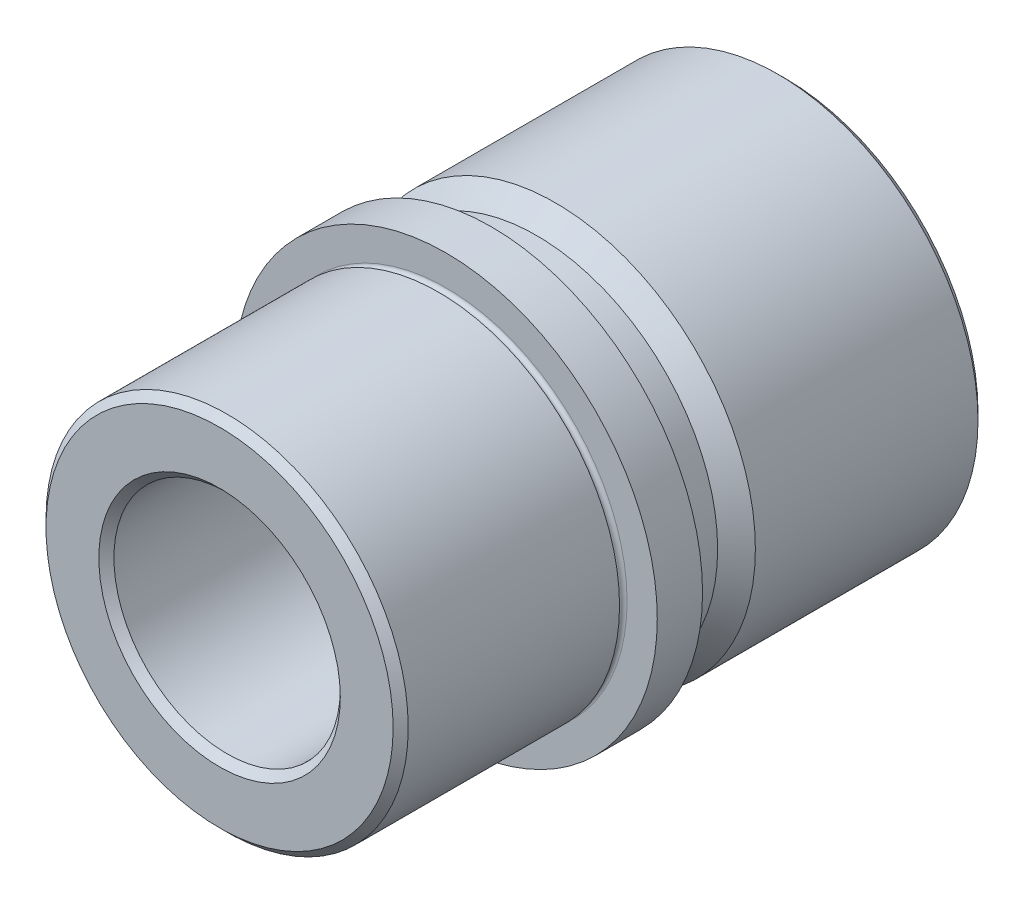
ISO-10303-21;
HEADER;
FILE_DESCRIPTION(('STEP AP214'),'2;1');
FILE_NAME('part.step','',(''),(''),'','','');
FILE_SCHEMA(('AUTOMOTIVE_DESIGN { 1 0 10303 214 1 1 1 1 }'));
ENDSEC;
DATA;
#1=APPLICATION_CONTEXT('core data for automotive mechanical design processes');
#2=APPLICATION_PROTOCOL_DEFINITION('international standard','automotive_design',2000,#1);
#3=PRODUCT_CONTEXT('',#1,'mechanical');
#4=PRODUCT('Part','Part','',(#3));
#5=PRODUCT_RELATED_PRODUCT_CATEGORY('part','',(#4));
#6=PRODUCT_DEFINITION_FORMATION('','',#4);
#7=PRODUCT_DEFINITION_CONTEXT('part definition',#1,'design');
#8=PRODUCT_DEFINITION('design','',#6,#7);
#9=PRODUCT_DEFINITION_SHAPE('','',#8);
#10=(LENGTH_UNIT() NAMED_UNIT(*) SI_UNIT(.MILLI.,.METRE.));
#11=(NAMED_UNIT(*) PLANE_ANGLE_UNIT() SI_UNIT($,.RADIAN.));
#12=(NAMED_UNIT(*) SI_UNIT($,.STERADIAN.) SOLID_ANGLE_UNIT());
#13=UNCERTAINTY_MEASURE_WITH_UNIT(LENGTH_MEASURE(1.E-05),#10,'distance_accuracy_value','');
#14=(GEOMETRIC_REPRESENTATION_CONTEXT(3) GLOBAL_UNCERTAINTY_ASSIGNED_CONTEXT((#13)) GLOBAL_UNIT_ASSIGNED_CONTEXT((#10,
#11,#12)) REPRESENTATION_CONTEXT('',''));
#15=CARTESIAN_POINT('',(0.,0.,0.));
#16=DIRECTION('',(0.,0.,1.));
#17=DIRECTION('',(1.,0.,0.));
#18=AXIS2_PLACEMENT_3D('',#15,#16,#17);
#19=CARTESIAN_POINT('',(0.,0.,-47.5));
#20=DIRECTION('',(0.,0.,1.));
#21=DIRECTION('',(1.,0.,0.));
#22=AXIS2_PLACEMENT_3D('',#19,#20,#21);
#23=TOROIDAL_SURFACE('',#22,15.5,0.5);
#24=CARTESIAN_POINT('',(0.,0.,-47.5));
#25=DIRECTION('',(0.,0.,1.));
#26=DIRECTION('',(1.,0.,0.));
#27=AXIS2_PLACEMENT_3D('',#24,#25,#26);
#28=CIRCLE('',#27,15.);
#29=CARTESIAN_POINT('',(15.,0.,-47.5));
#30=VERTEX_POINT('',#29);
#31=EDGE_CURVE('E81',#30,#30,#28,.T.);
#32=ORIENTED_EDGE('',*,*,#31,.T.);
#33=EDGE_LOOP('',(#32));
#34=FACE_BOUND('',#33,.T.);
#35=CARTESIAN_POINT('',(0.,0.,-48.));
#36=DIRECTION('',(0.,0.,1.));
#37=DIRECTION('',(1.,0.,0.));
#38=AXIS2_PLACEMENT_3D('',#35,#36,#37);
#39=CIRCLE('',#38,15.5);
#40=CARTESIAN_POINT('',(15.5,0.,-48.));
#41=VERTEX_POINT('',#40);
#42=EDGE_CURVE('E45',#41,#41,#39,.T.);
#43=ORIENTED_EDGE('',*,*,#42,.F.);
#44=EDGE_LOOP('',(#43));
#45=FACE_BOUND('',#44,.T.);
#46=ADVANCED_FACE('F13',(#34,#45),#23,.T.);
#47=CARTESIAN_POINT('',(0.,0.,-48.5));
#48=DIRECTION('',(0.,0.,1.));
#49=DIRECTION('',(1.,0.,0.));
#50=AXIS2_PLACEMENT_3D('',#47,#48,#49);
#51=TOROIDAL_SURFACE('',#50,15.5,0.5);
#52=CARTESIAN_POINT('',(0.,0.,-48.5));
#53=DIRECTION('',(0.,0.,1.));
#54=DIRECTION('',(1.,0.,0.));
#55=AXIS2_PLACEMENT_3D('',#52,#53,#54);
#56=CIRCLE('',#55,15.);
#57=CARTESIAN_POINT('',(15.,0.,-48.5));
#58=VERTEX_POINT('',#57);
#59=EDGE_CURVE('E48',#58,#58,#56,.T.);
#60=ORIENTED_EDGE('',*,*,#59,.F.);
#61=EDGE_LOOP('',(#60));
#62=FACE_BOUND('',#61,.T.);
#63=ORIENTED_EDGE('',*,*,#42,.T.);
#64=EDGE_LOOP('',(#63));
#65=FACE_BOUND('',#64,.T.);
#66=ADVANCED_FACE('F114',(#62,#65),#51,.T.);
#67=CARTESIAN_POINT('',(0.,0.,0.));
#68=DIRECTION('',(0.,0.,1.));
#69=DIRECTION('',(1.,0.,0.));
#70=AXIS2_PLACEMENT_3D('',#67,#68,#69);
#71=CYLINDRICAL_SURFACE('',#70,15.);
#72=CARTESIAN_POINT('',(0.,0.,-74.));
#73=DIRECTION('',(0.,0.,1.));
#74=DIRECTION('',(1.,0.,0.));
#75=AXIS2_PLACEMENT_3D('',#72,#73,#74);
#76=CIRCLE('',#75,15.);
#77=CARTESIAN_POINT('',(15.,0.,-74.));
#78=VERTEX_POINT('',#77);
#79=EDGE_CURVE('E36',#78,#78,#76,.F.);
#80=ORIENTED_EDGE('',*,*,#79,.T.);
#81=EDGE_LOOP('',(#80));
#82=FACE_BOUND('',#81,.T.);
#83=ORIENTED_EDGE('',*,*,#59,.T.);
#84=EDGE_LOOP('',(#83));
#85=FACE_BOUND('',#84,.T.);
#86=ADVANCED_FACE('F120',(#82,#85),#71,.F.);
#87=CARTESIAN_POINT('',(0.,0.,-75.));
#88=DIRECTION('',(0.,0.,1.));
#89=DIRECTION('',(1.,0.,0.));
#90=AXIS2_PLACEMENT_3D('',#87,#88,#89);
#91=PLANE('',#90);
#92=CARTESIAN_POINT('',(0.,0.,-75.));
#93=DIRECTION('',(0.,0.,1.));
#94=DIRECTION('',(1.,0.,0.));
#95=AXIS2_PLACEMENT_3D('',#92,#93,#94);
#96=CIRCLE('',#95,16.);
#97=CARTESIAN_POINT('',(16.,0.,-75.));
#98=VERTEX_POINT('',#97);
#99=EDGE_CURVE('E39',#98,#98,#96,.T.);
#100=ORIENTED_EDGE('',*,*,#99,.T.);
#101=EDGE_LOOP('',(#100));
#102=FACE_BOUND('',#101,.T.);
#103=CARTESIAN_POINT('',(0.,0.,-75.));
#104=DIRECTION('',(0.,0.,1.));
#105=DIRECTION('',(1.,0.,0.));
#106=AXIS2_PLACEMENT_3D('',#103,#104,#105);
#107=CIRCLE('',#106,25.5);
#108=CARTESIAN_POINT('',(25.5,0.,-75.));
#109=VERTEX_POINT('',#108);
#110=EDGE_CURVE('E42',#109,#109,#107,.F.);
#111=ORIENTED_EDGE('',*,*,#110,.T.);
#112=EDGE_LOOP('',(#111));
#113=FACE_BOUND('',#112,.T.);
#114=ADVANCED_FACE('F185',(#102,#113),#91,.F.);
#115=CARTESIAN_POINT('',(0.,0.,0.));
#116=DIRECTION('',(0.,0.,1.));
#117=DIRECTION('',(1.,0.,0.));
#118=AXIS2_PLACEMENT_3D('',#115,#116,#117);
#119=CYLINDRICAL_SURFACE('',#118,26.5);
#120=CARTESIAN_POINT('',(0.,0.,-74.));
#121=DIRECTION('',(0.,0.,1.));
#122=DIRECTION('',(1.,0.,0.));
#123=AXIS2_PLACEMENT_3D('',#120,#121,#122);
#124=CIRCLE('',#123,26.5);
#125=CARTESIAN_POINT('',(26.5,0.,-74.));
#126=VERTEX_POINT('',#125);
#127=EDGE_CURVE('E33',#126,#126,#124,.T.);
#128=ORIENTED_EDGE('',*,*,#127,.T.);
#129=EDGE_LOOP('',(#128));
#130=FACE_BOUND('',#129,.T.);
#131=CARTESIAN_POINT('',(0.,0.,-44.5));
#132=DIRECTION('',(0.,0.,1.));
#133=DIRECTION('',(1.,0.,0.));
#134=AXIS2_PLACEMENT_3D('',#131,#132,#133);
#135=CIRCLE('',#134,26.5);
#136=CARTESIAN_POINT('',(26.5,0.,-44.5));
#137=VERTEX_POINT('',#136);
#138=EDGE_CURVE('E51',#137,#137,#135,.T.);
#139=ORIENTED_EDGE('',*,*,#138,.F.);
#140=EDGE_LOOP('',(#139));
#141=FACE_BOUND('',#140,.T.);
#142=ADVANCED_FACE('F181',(#130,#141),#119,.T.);
#143=CARTESIAN_POINT('',(0.,0.,-42.));
#144=DIRECTION('',(0.,0.,-1.));
#145=DIRECTION('',(-1.,0.,0.));
#146=AXIS2_PLACEMENT_3D('',#143,#144,#145);
#147=CONICAL_SURFACE('',#146,24.,0.78539816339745);
#148=ORIENTED_EDGE('',*,*,#138,.T.);
#149=EDGE_LOOP('',(#148));
#150=FACE_BOUND('',#149,.T.);
#151=CARTESIAN_POINT('',(0.,0.,-42.));
#152=DIRECTION('',(0.,0.,1.));
#153=DIRECTION('',(1.,0.,0.));
#154=AXIS2_PLACEMENT_3D('',#151,#152,#153);
#155=CIRCLE('',#154,24.);
#156=CARTESIAN_POINT('',(24.,0.,-42.));
#157=VERTEX_POINT('',#156);
#158=EDGE_CURVE('E54',#157,#157,#155,.T.);
#159=ORIENTED_EDGE('',*,*,#158,.F.);
#160=EDGE_LOOP('',(#159));
#161=FACE_BOUND('',#160,.T.);
#162=ADVANCED_FACE('F177',(#150,#161),#147,.T.);
#163=CARTESIAN_POINT('',(0.,0.,0.));
#164=DIRECTION('',(0.,0.,1.));
#165=DIRECTION('',(1.,0.,0.));
#166=AXIS2_PLACEMENT_3D('',#163,#164,#165);
#167=CYLINDRICAL_SURFACE('',#166,24.);
#168=ORIENTED_EDGE('',*,*,#158,.T.);
#169=EDGE_LOOP('',(#168));
#170=FACE_BOUND('',#169,.T.);
#171=CARTESIAN_POINT('',(0.,0.,-36.));
#172=DIRECTION('',(0.,0.,1.));
#173=DIRECTION('',(1.,0.,0.));
#174=AXIS2_PLACEMENT_3D('',#171,#172,#173);
#175=CIRCLE('',#174,24.);
#176=CARTESIAN_POINT('',(24.,0.,-36.));
#177=VERTEX_POINT('',#176);
#178=EDGE_CURVE('E57',#177,#177,#175,.T.);
#179=ORIENTED_EDGE('',*,*,#178,.F.);
#180=EDGE_LOOP('',(#179));
#181=FACE_BOUND('',#180,.T.);
#182=ADVANCED_FACE('F173',(#170,#181),#167,.T.);
#183=CARTESIAN_POINT('',(0.,0.,-36.));
#184=DIRECTION('',(0.,0.,-1.));
#185=DIRECTION('',(-1.,0.,0.));
#186=AXIS2_PLACEMENT_3D('',#183,#184,#185);
#187=PLANE('',#186);
#188=ORIENTED_EDGE('',*,*,#178,.T.);
#189=EDGE_LOOP('',(#188));
#190=FACE_BOUND('',#189,.T.);
#191=CARTESIAN_POINT('',(0.,0.,-36.));
#192=DIRECTION('',(0.,0.,1.));
#193=DIRECTION('',(1.,0.,0.));
#194=AXIS2_PLACEMENT_3D('',#191,#192,#193);
#195=CIRCLE('',#194,28.);
#196=CARTESIAN_POINT('',(28.,0.,-36.));
#197=VERTEX_POINT('',#196);
#198=EDGE_CURVE('E60',#197,#197,#195,.T.);
#199=ORIENTED_EDGE('',*,*,#198,.F.);
#200=EDGE_LOOP('',(#199));
#201=FACE_BOUND('',#200,.T.);
#202=ADVANCED_FACE('F169',(#190,#201),#187,.T.);
#203=CARTESIAN_POINT('',(0.,0.,0.));
#204=DIRECTION('',(0.,0.,1.));
#205=DIRECTION('',(1.,0.,0.));
#206=AXIS2_PLACEMENT_3D('',#203,#204,#205);
#207=CYLINDRICAL_SURFACE('',#206,28.);
#208=ORIENTED_EDGE('',*,*,#198,.T.);
#209=EDGE_LOOP('',(#208));
#210=FACE_BOUND('',#209,.T.);
#211=CARTESIAN_POINT('',(0.,0.,-30.));
#212=DIRECTION('',(0.,0.,1.));
#213=DIRECTION('',(1.,0.,0.));
#214=AXIS2_PLACEMENT_3D('',#211,#212,#213);
#215=CIRCLE('',#214,28.);
#216=CARTESIAN_POINT('',(28.,0.,-30.));
#217=VERTEX_POINT('',#216);
#218=EDGE_CURVE('E63',#217,#217,#215,.T.);
#219=ORIENTED_EDGE('',*,*,#218,.F.);
#220=EDGE_LOOP('',(#219));
#221=FACE_BOUND('',#220,.T.);
#222=ADVANCED_FACE('F165',(#210,#221),#207,.T.);
#223=CARTESIAN_POINT('',(0.,0.,-30.));
#224=DIRECTION('',(0.,0.,1.));
#225=DIRECTION('',(1.,0.,0.));
#226=AXIS2_PLACEMENT_3D('',#223,#224,#225);
#227=PLANE('',#226);
#228=ORIENTED_EDGE('',*,*,#218,.T.);
#229=EDGE_LOOP('',(#228));
#230=FACE_BOUND('',#229,.T.);
#231=CARTESIAN_POINT('',(0.,0.,-30.));
#232=DIRECTION('',(0.,0.,1.));
#233=DIRECTION('',(1.,0.,0.));
#234=AXIS2_PLACEMENT_3D('',#231,#232,#233);
#235=CIRCLE('',#234,24.);
#236=CARTESIAN_POINT('',(24.,0.,-30.));
#237=VERTEX_POINT('',#236);
#238=EDGE_CURVE('E66',#237,#237,#235,.T.);
#239=ORIENTED_EDGE('',*,*,#238,.F.);
#240=EDGE_LOOP('',(#239));
#241=FACE_BOUND('',#240,.T.);
#242=ADVANCED_FACE('F161',(#230,#241),#227,.T.);
#243=CARTESIAN_POINT('',(0.,0.,-29.5));
#244=DIRECTION('',(0.,0.,1.));
#245=DIRECTION('',(1.,0.,0.));
#246=AXIS2_PLACEMENT_3D('',#243,#244,#245);
#247=TOROIDAL_SURFACE('',#246,24.,0.5);
#248=ORIENTED_EDGE('',*,*,#238,.T.);
#249=EDGE_LOOP('',(#248));
#250=FACE_BOUND('',#249,.T.);
#251=CARTESIAN_POINT('',(0.,0.,-29.));
#252=DIRECTION('',(0.,0.,1.));
#253=DIRECTION('',(1.,0.,0.));
#254=AXIS2_PLACEMENT_3D('',#251,#252,#253);
#255=CIRCLE('',#254,24.);
#256=CARTESIAN_POINT('',(24.,0.,-29.));
#257=VERTEX_POINT('',#256);
#258=EDGE_CURVE('E69',#257,#257,#255,.T.);
#259=ORIENTED_EDGE('',*,*,#258,.F.);
#260=EDGE_LOOP('',(#259));
#261=FACE_BOUND('',#260,.T.);
#262=ADVANCED_FACE('F156',(#250,#261),#247,.F.);
#263=CARTESIAN_POINT('',(0.,0.,0.));
#264=DIRECTION('',(0.,0.,1.));
#265=DIRECTION('',(1.,0.,0.));
#266=AXIS2_PLACEMENT_3D('',#263,#264,#265);
#267=CYLINDRICAL_SURFACE('',#266,24.);
#268=CARTESIAN_POINT('',(0.,0.,-1.));
#269=DIRECTION('',(0.,0.,1.));
#270=DIRECTION('',(1.,0.,0.));
#271=AXIS2_PLACEMENT_3D('',#268,#269,#270);
#272=CIRCLE('',#271,24.);
#273=CARTESIAN_POINT('',(24.,0.,-1.));
#274=VERTEX_POINT('',#273);
#275=EDGE_CURVE('E8',#274,#274,#272,.F.);
#276=ORIENTED_EDGE('',*,*,#275,.T.);
#277=EDGE_LOOP('',(#276));
#278=FACE_BOUND('',#277,.T.);
#279=ORIENTED_EDGE('',*,*,#258,.T.);
#280=EDGE_LOOP('',(#279));
#281=FACE_BOUND('',#280,.T.);
#282=ADVANCED_FACE('F150',(#278,#281),#267,.T.);
#283=CARTESIAN_POINT('',(0.,0.,0.));
#284=DIRECTION('',(0.,0.,1.));
#285=DIRECTION('',(1.,0.,0.));
#286=AXIS2_PLACEMENT_3D('',#283,#284,#285);
#287=PLANE('',#286);
#288=CARTESIAN_POINT('',(0.,0.,0.));
#289=DIRECTION('',(0.,0.,1.));
#290=DIRECTION('',(1.,0.,0.));
#291=AXIS2_PLACEMENT_3D('',#288,#289,#290);
#292=CIRCLE('',#291,16.);
#293=CARTESIAN_POINT('',(16.,0.,0.));
#294=VERTEX_POINT('',#293);
#295=EDGE_CURVE('E20',#294,#294,#292,.F.);
#296=ORIENTED_EDGE('',*,*,#295,.T.);
#297=EDGE_LOOP('',(#296));
#298=FACE_BOUND('',#297,.T.);
#299=CARTESIAN_POINT('',(0.,0.,0.));
#300=DIRECTION('',(0.,0.,1.));
#301=DIRECTION('',(1.,0.,0.));
#302=AXIS2_PLACEMENT_3D('',#299,#300,#301);
#303=CIRCLE('',#302,23.);
#304=CARTESIAN_POINT('',(23.,0.,0.));
#305=VERTEX_POINT('',#304);
#306=EDGE_CURVE('E24',#305,#305,#303,.T.);
#307=ORIENTED_EDGE('',*,*,#306,.T.);
#308=EDGE_LOOP('',(#307));
#309=FACE_BOUND('',#308,.T.);
#310=ADVANCED_FACE('F110',(#298,#309),#287,.T.);
#311=CARTESIAN_POINT('',(0.,0.,0.));
#312=DIRECTION('',(0.,0.,1.));
#313=DIRECTION('',(1.,0.,0.));
#314=AXIS2_PLACEMENT_3D('',#311,#312,#313);
#315=CYLINDRICAL_SURFACE('',#314,15.);
#316=CARTESIAN_POINT('',(0.,0.,-1.));
#317=DIRECTION('',(0.,0.,1.));
#318=DIRECTION('',(1.,0.,0.));
#319=AXIS2_PLACEMENT_3D('',#316,#317,#318);
#320=CIRCLE('',#319,15.);
#321=CARTESIAN_POINT('',(15.,0.,-1.));
#322=VERTEX_POINT('',#321);
#323=EDGE_CURVE('E28',#322,#322,#320,.T.);
#324=ORIENTED_EDGE('',*,*,#323,.T.);
#325=EDGE_LOOP('',(#324));
#326=FACE_BOUND('',#325,.T.);
#327=CARTESIAN_POINT('',(0.,0.,-22.5));
#328=DIRECTION('',(0.,0.,1.));
#329=DIRECTION('',(1.,0.,0.));
#330=AXIS2_PLACEMENT_3D('',#327,#328,#329);
#331=CIRCLE('',#330,15.);
#332=CARTESIAN_POINT('',(15.,0.,-22.5));
#333=VERTEX_POINT('',#332);
#334=EDGE_CURVE('E72',#333,#333,#331,.T.);
#335=ORIENTED_EDGE('',*,*,#334,.F.);
#336=EDGE_LOOP('',(#335));
#337=FACE_BOUND('',#336,.T.);
#338=ADVANCED_FACE('F102',(#326,#337),#315,.F.);
#339=CARTESIAN_POINT('',(0.,0.,-22.5));
#340=DIRECTION('',(0.,0.,1.));
#341=DIRECTION('',(1.,0.,0.));
#342=AXIS2_PLACEMENT_3D('',#339,#340,#341);
#343=TOROIDAL_SURFACE('',#342,15.5,0.5);
#344=ORIENTED_EDGE('',*,*,#334,.T.);
#345=EDGE_LOOP('',(#344));
#346=FACE_BOUND('',#345,.T.);
#347=CARTESIAN_POINT('',(0.,0.,-23.));
#348=DIRECTION('',(0.,0.,1.));
#349=DIRECTION('',(1.,0.,0.));
#350=AXIS2_PLACEMENT_3D('',#347,#348,#349);
#351=CIRCLE('',#350,15.5);
#352=CARTESIAN_POINT('',(15.5,0.,-23.));
#353=VERTEX_POINT('',#352);
#354=EDGE_CURVE('E75',#353,#353,#351,.T.);
#355=ORIENTED_EDGE('',*,*,#354,.F.);
#356=EDGE_LOOP('',(#355));
#357=FACE_BOUND('',#356,.T.);
#358=ADVANCED_FACE('F97',(#346,#357),#343,.T.);
#359=CARTESIAN_POINT('',(0.,0.,-23.5));
#360=DIRECTION('',(0.,0.,1.));
#361=DIRECTION('',(1.,0.,0.));
#362=AXIS2_PLACEMENT_3D('',#359,#360,#361);
#363=TOROIDAL_SURFACE('',#362,15.5,0.5);
#364=CARTESIAN_POINT('',(0.,0.,-23.5));
#365=DIRECTION('',(0.,0.,1.));
#366=DIRECTION('',(1.,0.,0.));
#367=AXIS2_PLACEMENT_3D('',#364,#365,#366);
#368=CIRCLE('',#367,15.);
#369=CARTESIAN_POINT('',(15.,0.,-23.5));
#370=VERTEX_POINT('',#369);
#371=EDGE_CURVE('E78',#370,#370,#368,.T.);
#372=ORIENTED_EDGE('',*,*,#371,.F.);
#373=EDGE_LOOP('',(#372));
#374=FACE_BOUND('',#373,.T.);
#375=ORIENTED_EDGE('',*,*,#354,.T.);
#376=EDGE_LOOP('',(#375));
#377=FACE_BOUND('',#376,.T.);
#378=ADVANCED_FACE('F91',(#374,#377),#363,.T.);
#379=CARTESIAN_POINT('',(0.,0.,0.));
#380=DIRECTION('',(0.,0.,1.));
#381=DIRECTION('',(1.,0.,0.));
#382=AXIS2_PLACEMENT_3D('',#379,#380,#381);
#383=CYLINDRICAL_SURFACE('',#382,15.);
#384=ORIENTED_EDGE('',*,*,#31,.F.);
#385=EDGE_LOOP('',(#384));
#386=FACE_BOUND('',#385,.T.);
#387=ORIENTED_EDGE('',*,*,#371,.T.);
#388=EDGE_LOOP('',(#387));
#389=FACE_BOUND('',#388,.T.);
#390=ADVANCED_FACE('F87',(#386,#389),#383,.F.);
#391=CARTESIAN_POINT('',(0.,0.,-75.));
#392=DIRECTION('',(0.,0.,-1.));
#393=DIRECTION('',(-1.,0.,0.));
#394=AXIS2_PLACEMENT_3D('',#391,#392,#393);
#395=CONICAL_SURFACE('',#394,16.,0.785398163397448);
#396=ORIENTED_EDGE('',*,*,#79,.F.);
#397=EDGE_LOOP('',(#396));
#398=FACE_BOUND('',#397,.T.);
#399=ORIENTED_EDGE('',*,*,#99,.F.);
#400=EDGE_LOOP('',(#399));
#401=FACE_BOUND('',#400,.T.);
#402=ADVANCED_FACE('F90',(#398,#401),#395,.F.);
#403=CARTESIAN_POINT('',(0.,0.,-74.));
#404=DIRECTION('',(0.,0.,1.));
#405=DIRECTION('',(1.,0.,0.));
#406=AXIS2_PLACEMENT_3D('',#403,#404,#405);
#407=CONICAL_SURFACE('',#406,26.5,0.78539816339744);
#408=ORIENTED_EDGE('',*,*,#110,.F.);
#409=EDGE_LOOP('',(#408));
#410=FACE_BOUND('',#409,.T.);
#411=ORIENTED_EDGE('',*,*,#127,.F.);
#412=EDGE_LOOP('',(#411));
#413=FACE_BOUND('',#412,.T.);
#414=ADVANCED_FACE('F127',(#410,#413),#407,.T.);
#415=CARTESIAN_POINT('',(0.,0.,-1.));
#416=DIRECTION('',(0.,0.,1.));
#417=DIRECTION('',(1.,0.,0.));
#418=AXIS2_PLACEMENT_3D('',#415,#416,#417);
#419=CONICAL_SURFACE('',#418,15.,0.785398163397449);
#420=ORIENTED_EDGE('',*,*,#295,.F.);
#421=EDGE_LOOP('',(#420));
#422=FACE_BOUND('',#421,.T.);
#423=ORIENTED_EDGE('',*,*,#323,.F.);
#424=EDGE_LOOP('',(#423));
#425=FACE_BOUND('',#424,.T.);
#426=ADVANCED_FACE('F130',(#422,#425),#419,.F.);
#427=CARTESIAN_POINT('',(0.,0.,0.));
#428=DIRECTION('',(0.,0.,-1.));
#429=DIRECTION('',(-1.,0.,0.));
#430=AXIS2_PLACEMENT_3D('',#427,#428,#429);
#431=CONICAL_SURFACE('',#430,23.,0.785398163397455);
#432=ORIENTED_EDGE('',*,*,#275,.F.);
#433=EDGE_LOOP('',(#432));
#434=FACE_BOUND('',#433,.T.);
#435=ORIENTED_EDGE('',*,*,#306,.F.);
#436=EDGE_LOOP('',(#435));
#437=FACE_BOUND('',#436,.T.);
#438=ADVANCED_FACE('F15',(#434,#437),#431,.T.);
#439=CLOSED_SHELL('',(#46,#66,#86,#114,#142,#162,#182,#202,#222,#242,#262,#282,#310,#338,#358,
#378,#390,#402,#414,#426,#438));
#440=MANIFOLD_SOLID_BREP('B1',#439);
#441=ADVANCED_BREP_SHAPE_REPRESENTATION('',(#18,#440),#14);
#442=SHAPE_DEFINITION_REPRESENTATION(#9,#441);
ENDSEC;
END-ISO-10303-21;
